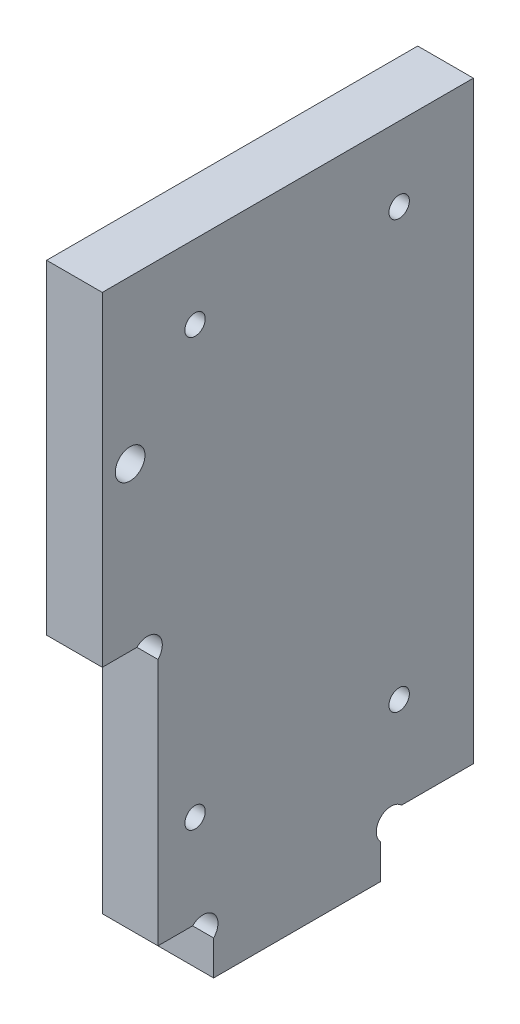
ISO-10303-21;
HEADER;
FILE_DESCRIPTION(('STEP AP214'),'2;1');
FILE_NAME('part.step','',(''),(''),'','','');
FILE_SCHEMA(('AUTOMOTIVE_DESIGN { 1 0 10303 214 1 1 1 1 }'));
ENDSEC;
DATA;
#1=APPLICATION_CONTEXT('core data for automotive mechanical design processes');
#2=APPLICATION_PROTOCOL_DEFINITION('international standard','automotive_design',2000,#1);
#3=PRODUCT_CONTEXT('',#1,'mechanical');
#4=PRODUCT('Part','Part','',(#3));
#5=PRODUCT_RELATED_PRODUCT_CATEGORY('part','',(#4));
#6=PRODUCT_DEFINITION_FORMATION('','',#4);
#7=PRODUCT_DEFINITION_CONTEXT('part definition',#1,'design');
#8=PRODUCT_DEFINITION('design','',#6,#7);
#9=PRODUCT_DEFINITION_SHAPE('','',#8);
#10=(LENGTH_UNIT() NAMED_UNIT(*) SI_UNIT(.MILLI.,.METRE.));
#11=(NAMED_UNIT(*) PLANE_ANGLE_UNIT() SI_UNIT($,.RADIAN.));
#12=(NAMED_UNIT(*) SI_UNIT($,.STERADIAN.) SOLID_ANGLE_UNIT());
#13=UNCERTAINTY_MEASURE_WITH_UNIT(LENGTH_MEASURE(1.E-05),#10,'distance_accuracy_value','');
#14=(GEOMETRIC_REPRESENTATION_CONTEXT(3) GLOBAL_UNCERTAINTY_ASSIGNED_CONTEXT((#13)) GLOBAL_UNIT_ASSIGNED_CONTEXT((#10,
#11,#12)) REPRESENTATION_CONTEXT('',''));
#15=CARTESIAN_POINT('',(0.,0.,0.));
#16=DIRECTION('',(0.,0.,1.));
#17=DIRECTION('',(1.,0.,0.));
#18=AXIS2_PLACEMENT_3D('',#15,#16,#17);
#19=CARTESIAN_POINT('',(6.,4.86862915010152,-10.1313708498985));
#20=DIRECTION('',(1.,0.,0.));
#21=DIRECTION('',(0.,0.,-1.));
#22=AXIS2_PLACEMENT_3D('',#19,#20,#21);
#23=PLANE('',#22);
#24=CARTESIAN_POINT('',(6.,16.,11.));
#25=DIRECTION('',(1.,0.,0.));
#26=DIRECTION('',(0.,0.,1.));
#27=AXIS2_PLACEMENT_3D('',#24,#25,#26);
#28=CIRCLE('',#27,1.1);
#29=CARTESIAN_POINT('',(6.,16.,12.1));
#30=VERTEX_POINT('',#29);
#31=EDGE_CURVE('E313',#30,#30,#28,.T.);
#32=ORIENTED_EDGE('',*,*,#31,.F.);
#33=EDGE_LOOP('',(#32));
#34=FACE_BOUND('',#33,.T.);
#35=CARTESIAN_POINT('',(6.,62.,-11.));
#36=DIRECTION('',(1.,0.,0.));
#37=DIRECTION('',(0.,0.,-1.));
#38=AXIS2_PLACEMENT_3D('',#35,#36,#37);
#39=CIRCLE('',#38,1.1);
#40=CARTESIAN_POINT('',(6.,62.,-12.1));
#41=VERTEX_POINT('',#40);
#42=EDGE_CURVE('E325',#41,#41,#39,.T.);
#43=ORIENTED_EDGE('',*,*,#42,.F.);
#44=EDGE_LOOP('',(#43));
#45=FACE_BOUND('',#44,.T.);
#46=CARTESIAN_POINT('',(6.,4.86862915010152,-10.1313708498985));
#47=DIRECTION('',(-1.,0.,0.));
#48=DIRECTION('',(0.,0.,-1.));
#49=AXIS2_PLACEMENT_3D('',#46,#47,#48);
#50=CIRCLE('',#49,1.6);
#51=CARTESIAN_POINT('',(6.,3.73725830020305,-9.));
#52=VERTEX_POINT('',#51);
#53=CARTESIAN_POINT('',(6.,5.99999999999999,-11.262741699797));
#54=VERTEX_POINT('',#53);
#55=EDGE_CURVE('E189',#52,#54,#50,.T.);
#56=ORIENTED_EDGE('',*,*,#55,.T.);
#57=DIRECTION('',(0.,0.,-1.));
#58=VECTOR('',#57,1.);
#59=CARTESIAN_POINT('',(6.,5.99999999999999,-11.262741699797));
#60=LINE('',#59,#58);
#61=CARTESIAN_POINT('',(6.,6.,-19.));
#62=VERTEX_POINT('',#61);
#63=EDGE_CURVE('E112',#54,#62,#60,.T.);
#64=ORIENTED_EDGE('',*,*,#63,.T.);
#65=DIRECTION('',(0.,1.,0.));
#66=VECTOR('',#65,1.);
#67=CARTESIAN_POINT('',(6.,6.,-19.));
#68=LINE('',#67,#66);
#69=CARTESIAN_POINT('',(6.,70.,-19.));
#70=VERTEX_POINT('',#69);
#71=EDGE_CURVE('E219',#62,#70,#68,.T.);
#72=ORIENTED_EDGE('',*,*,#71,.T.);
#73=DIRECTION('',(0.,0.,1.));
#74=VECTOR('',#73,1.);
#75=CARTESIAN_POINT('',(6.,70.,-19.));
#76=LINE('',#75,#74);
#77=CARTESIAN_POINT('',(6.,70.,21.));
#78=VERTEX_POINT('',#77);
#79=EDGE_CURVE('E238',#70,#78,#76,.T.);
#80=ORIENTED_EDGE('',*,*,#79,.T.);
#81=DIRECTION('',(0.,-1.,0.));
#82=VECTOR('',#81,1.);
#83=CARTESIAN_POINT('',(6.,70.,21.));
#84=LINE('',#83,#82);
#85=CARTESIAN_POINT('',(6.,35.,21.));
#86=VERTEX_POINT('',#85);
#87=EDGE_CURVE('E235',#78,#86,#84,.T.);
#88=ORIENTED_EDGE('',*,*,#87,.T.);
#89=DIRECTION('',(0.,0.,-1.));
#90=VECTOR('',#89,1.);
#91=CARTESIAN_POINT('',(6.,35.,21.));
#92=LINE('',#91,#90);
#93=CARTESIAN_POINT('',(6.,35.,17.262741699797));
#94=VERTEX_POINT('',#93);
#95=EDGE_CURVE('E237',#86,#94,#92,.T.);
#96=ORIENTED_EDGE('',*,*,#95,.T.);
#97=CARTESIAN_POINT('',(6.,33.8686291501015,16.1313708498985));
#98=DIRECTION('',(-1.,0.,0.));
#99=DIRECTION('',(0.,0.,-1.));
#100=AXIS2_PLACEMENT_3D('',#97,#98,#99);
#101=CIRCLE('',#100,1.60000000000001);
#102=CARTESIAN_POINT('',(6.,32.737258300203,15.));
#103=VERTEX_POINT('',#102);
#104=EDGE_CURVE('E240',#94,#103,#101,.T.);
#105=ORIENTED_EDGE('',*,*,#104,.T.);
#106=DIRECTION('',(0.,-1.,0.));
#107=VECTOR('',#106,1.);
#108=CARTESIAN_POINT('',(6.,32.737258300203,15.));
#109=LINE('',#108,#107);
#110=CARTESIAN_POINT('',(6.,5.99999999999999,15.));
#111=VERTEX_POINT('',#110);
#112=EDGE_CURVE('E246',#103,#111,#109,.T.);
#113=ORIENTED_EDGE('',*,*,#112,.T.);
#114=DIRECTION('',(0.,0.,-1.));
#115=VECTOR('',#114,1.);
#116=CARTESIAN_POINT('',(6.,5.99999999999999,11.262741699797));
#117=LINE('',#116,#115);
#118=CARTESIAN_POINT('',(6.,5.99999999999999,11.262741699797));
#119=VERTEX_POINT('',#118);
#120=EDGE_CURVE('E248',#111,#119,#117,.T.);
#121=ORIENTED_EDGE('',*,*,#120,.T.);
#122=CARTESIAN_POINT('',(6.,4.86862915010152,10.1313708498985));
#123=DIRECTION('',(-1.,0.,0.));
#124=DIRECTION('',(0.,0.,1.));
#125=AXIS2_PLACEMENT_3D('',#122,#123,#124);
#126=CIRCLE('',#125,1.6);
#127=CARTESIAN_POINT('',(6.,3.73725830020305,9.));
#128=VERTEX_POINT('',#127);
#129=EDGE_CURVE('E146',#119,#128,#126,.T.);
#130=ORIENTED_EDGE('',*,*,#129,.T.);
#131=DIRECTION('',(0.,-1.,0.));
#132=VECTOR('',#131,1.);
#133=CARTESIAN_POINT('',(6.,3.73725830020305,9.));
#134=LINE('',#133,#132);
#135=CARTESIAN_POINT('',(6.,0.,9.));
#136=VERTEX_POINT('',#135);
#137=EDGE_CURVE('E140',#128,#136,#134,.T.);
#138=ORIENTED_EDGE('',*,*,#137,.T.);
#139=DIRECTION('',(0.,0.,-1.));
#140=VECTOR('',#139,1.);
#141=CARTESIAN_POINT('',(6.,0.,9.));
#142=LINE('',#141,#140);
#143=CARTESIAN_POINT('',(6.,0.,-9.));
#144=VERTEX_POINT('',#143);
#145=EDGE_CURVE('E144',#136,#144,#142,.T.);
#146=ORIENTED_EDGE('',*,*,#145,.T.);
#147=DIRECTION('',(0.,1.,0.));
#148=VECTOR('',#147,1.);
#149=CARTESIAN_POINT('',(6.,3.73725830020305,-9.));
#150=LINE('',#149,#148);
#151=EDGE_CURVE('E54',#144,#52,#150,.T.);
#152=ORIENTED_EDGE('',*,*,#151,.T.);
#153=EDGE_LOOP('',(#56,#64,#72,#80,#88,#96,#105,#113,#121,#130,#138,#146,#152));
#154=FACE_BOUND('',#153,.T.);
#155=CARTESIAN_POINT('',(6.,16.,-11.));
#156=DIRECTION('',(1.,0.,0.));
#157=DIRECTION('',(0.,0.,-1.));
#158=AXIS2_PLACEMENT_3D('',#155,#156,#157);
#159=CIRCLE('',#158,1.1);
#160=CARTESIAN_POINT('',(6.,16.,-12.1));
#161=VERTEX_POINT('',#160);
#162=EDGE_CURVE('E168',#161,#161,#159,.T.);
#163=ORIENTED_EDGE('',*,*,#162,.F.);
#164=EDGE_LOOP('',(#163));
#165=FACE_BOUND('',#164,.T.);
#166=CARTESIAN_POINT('',(6.,62.,11.));
#167=DIRECTION('',(1.,0.,0.));
#168=DIRECTION('',(0.,0.,1.));
#169=AXIS2_PLACEMENT_3D('',#166,#167,#168);
#170=CIRCLE('',#169,1.1);
#171=CARTESIAN_POINT('',(6.,62.,12.1));
#172=VERTEX_POINT('',#171);
#173=EDGE_CURVE('E319',#172,#172,#170,.T.);
#174=ORIENTED_EDGE('',*,*,#173,.F.);
#175=EDGE_LOOP('',(#174));
#176=FACE_BOUND('',#175,.T.);
#177=CARTESIAN_POINT('',(6.,52.5,18.));
#178=DIRECTION('',(1.,0.,0.));
#179=DIRECTION('',(0.,0.,-1.));
#180=AXIS2_PLACEMENT_3D('',#177,#178,#179);
#181=CIRCLE('',#180,1.6);
#182=CARTESIAN_POINT('',(6.,52.5,16.4));
#183=VERTEX_POINT('',#182);
#184=EDGE_CURVE('E304',#183,#183,#181,.T.);
#185=ORIENTED_EDGE('',*,*,#184,.F.);
#186=EDGE_LOOP('',(#185));
#187=FACE_BOUND('',#186,.T.);
#188=ADVANCED_FACE('F37',(#34,#45,#154,#165,#176,#187),#23,.T.);
#189=CARTESIAN_POINT('',(0.,4.86862915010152,-10.1313708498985));
#190=DIRECTION('',(1.,0.,0.));
#191=DIRECTION('',(0.,0.,-1.));
#192=AXIS2_PLACEMENT_3D('',#189,#190,#191);
#193=PLANE('',#192);
#194=CARTESIAN_POINT('',(0.,16.,11.));
#195=DIRECTION('',(1.,0.,0.));
#196=DIRECTION('',(0.,0.,1.));
#197=AXIS2_PLACEMENT_3D('',#194,#195,#196);
#198=CIRCLE('',#197,1.1);
#199=CARTESIAN_POINT('',(0.,16.,12.1));
#200=VERTEX_POINT('',#199);
#201=EDGE_CURVE('E310',#200,#200,#198,.T.);
#202=ORIENTED_EDGE('',*,*,#201,.T.);
#203=EDGE_LOOP('',(#202));
#204=FACE_BOUND('',#203,.T.);
#205=CARTESIAN_POINT('',(0.,62.,-11.));
#206=DIRECTION('',(1.,0.,0.));
#207=DIRECTION('',(0.,0.,-1.));
#208=AXIS2_PLACEMENT_3D('',#205,#206,#207);
#209=CIRCLE('',#208,1.1);
#210=CARTESIAN_POINT('',(0.,62.,-12.1));
#211=VERTEX_POINT('',#210);
#212=EDGE_CURVE('E322',#211,#211,#209,.T.);
#213=ORIENTED_EDGE('',*,*,#212,.T.);
#214=EDGE_LOOP('',(#213));
#215=FACE_BOUND('',#214,.T.);
#216=CARTESIAN_POINT('',(0.,4.86862915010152,-10.1313708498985));
#217=DIRECTION('',(-1.,0.,0.));
#218=DIRECTION('',(0.,0.,-1.));
#219=AXIS2_PLACEMENT_3D('',#216,#217,#218);
#220=CIRCLE('',#219,1.6);
#221=CARTESIAN_POINT('',(0.,3.73725830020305,-9.));
#222=VERTEX_POINT('',#221);
#223=CARTESIAN_POINT('',(0.,5.99999999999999,-11.262741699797));
#224=VERTEX_POINT('',#223);
#225=EDGE_CURVE('E164',#222,#224,#220,.T.);
#226=ORIENTED_EDGE('',*,*,#225,.F.);
#227=DIRECTION('',(0.,1.,0.));
#228=VECTOR('',#227,1.);
#229=CARTESIAN_POINT('',(0.,3.73725830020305,-9.));
#230=LINE('',#229,#228);
#231=CARTESIAN_POINT('',(0.,0.,-9.));
#232=VERTEX_POINT('',#231);
#233=EDGE_CURVE('E104',#232,#222,#230,.T.);
#234=ORIENTED_EDGE('',*,*,#233,.F.);
#235=DIRECTION('',(0.,0.,-1.));
#236=VECTOR('',#235,1.);
#237=CARTESIAN_POINT('',(0.,0.,9.));
#238=LINE('',#237,#236);
#239=CARTESIAN_POINT('',(0.,0.,9.));
#240=VERTEX_POINT('',#239);
#241=EDGE_CURVE('E98',#240,#232,#238,.T.);
#242=ORIENTED_EDGE('',*,*,#241,.F.);
#243=DIRECTION('',(0.,-1.,0.));
#244=VECTOR('',#243,1.);
#245=CARTESIAN_POINT('',(0.,3.73725830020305,9.));
#246=LINE('',#245,#244);
#247=CARTESIAN_POINT('',(0.,3.73725830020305,9.));
#248=VERTEX_POINT('',#247);
#249=EDGE_CURVE('E154',#248,#240,#246,.T.);
#250=ORIENTED_EDGE('',*,*,#249,.F.);
#251=CARTESIAN_POINT('',(0.,4.86862915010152,10.1313708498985));
#252=DIRECTION('',(-1.,0.,0.));
#253=DIRECTION('',(0.,0.,1.));
#254=AXIS2_PLACEMENT_3D('',#251,#252,#253);
#255=CIRCLE('',#254,1.6);
#256=CARTESIAN_POINT('',(0.,5.99999999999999,11.262741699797));
#257=VERTEX_POINT('',#256);
#258=EDGE_CURVE('E184',#257,#248,#255,.T.);
#259=ORIENTED_EDGE('',*,*,#258,.F.);
#260=DIRECTION('',(0.,0.,-1.));
#261=VECTOR('',#260,1.);
#262=CARTESIAN_POINT('',(0.,5.99999999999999,11.262741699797));
#263=LINE('',#262,#261);
#264=CARTESIAN_POINT('',(0.,5.99999999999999,15.));
#265=VERTEX_POINT('',#264);
#266=EDGE_CURVE('E182',#265,#257,#263,.T.);
#267=ORIENTED_EDGE('',*,*,#266,.F.);
#268=DIRECTION('',(0.,-1.,0.));
#269=VECTOR('',#268,1.);
#270=CARTESIAN_POINT('',(0.,32.737258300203,15.));
#271=LINE('',#270,#269);
#272=CARTESIAN_POINT('',(0.,32.737258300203,15.));
#273=VERTEX_POINT('',#272);
#274=EDGE_CURVE('E180',#273,#265,#271,.T.);
#275=ORIENTED_EDGE('',*,*,#274,.F.);
#276=CARTESIAN_POINT('',(0.,33.8686291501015,16.1313708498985));
#277=DIRECTION('',(-1.,0.,0.));
#278=DIRECTION('',(0.,0.,-1.));
#279=AXIS2_PLACEMENT_3D('',#276,#277,#278);
#280=CIRCLE('',#279,1.60000000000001);
#281=CARTESIAN_POINT('',(0.,35.,17.262741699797));
#282=VERTEX_POINT('',#281);
#283=EDGE_CURVE('E178',#282,#273,#280,.T.);
#284=ORIENTED_EDGE('',*,*,#283,.F.);
#285=DIRECTION('',(0.,0.,-1.));
#286=VECTOR('',#285,1.);
#287=CARTESIAN_POINT('',(0.,35.,21.));
#288=LINE('',#287,#286);
#289=CARTESIAN_POINT('',(0.,35.,21.));
#290=VERTEX_POINT('',#289);
#291=EDGE_CURVE('E176',#290,#282,#288,.T.);
#292=ORIENTED_EDGE('',*,*,#291,.F.);
#293=DIRECTION('',(0.,-1.,0.));
#294=VECTOR('',#293,1.);
#295=CARTESIAN_POINT('',(0.,70.,21.));
#296=LINE('',#295,#294);
#297=CARTESIAN_POINT('',(0.,70.,21.));
#298=VERTEX_POINT('',#297);
#299=EDGE_CURVE('E174',#298,#290,#296,.T.);
#300=ORIENTED_EDGE('',*,*,#299,.F.);
#301=DIRECTION('',(0.,0.,1.));
#302=VECTOR('',#301,1.);
#303=CARTESIAN_POINT('',(0.,70.,-19.));
#304=LINE('',#303,#302);
#305=CARTESIAN_POINT('',(0.,70.,-19.));
#306=VERTEX_POINT('',#305);
#307=EDGE_CURVE('E172',#306,#298,#304,.T.);
#308=ORIENTED_EDGE('',*,*,#307,.F.);
#309=DIRECTION('',(0.,1.,0.));
#310=VECTOR('',#309,1.);
#311=CARTESIAN_POINT('',(0.,6.,-19.));
#312=LINE('',#311,#310);
#313=CARTESIAN_POINT('',(0.,6.,-19.));
#314=VERTEX_POINT('',#313);
#315=EDGE_CURVE('E170',#314,#306,#312,.T.);
#316=ORIENTED_EDGE('',*,*,#315,.F.);
#317=DIRECTION('',(0.,0.,-1.));
#318=VECTOR('',#317,1.);
#319=CARTESIAN_POINT('',(0.,5.99999999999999,-11.262741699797));
#320=LINE('',#319,#318);
#321=EDGE_CURVE('E167',#224,#314,#320,.T.);
#322=ORIENTED_EDGE('',*,*,#321,.F.);
#323=EDGE_LOOP('',(#226,#234,#242,#250,#259,#267,#275,#284,#292,#300,#308,#316,#322));
#324=FACE_BOUND('',#323,.T.);
#325=CARTESIAN_POINT('',(0.,16.,-11.));
#326=DIRECTION('',(1.,0.,0.));
#327=DIRECTION('',(0.,0.,-1.));
#328=AXIS2_PLACEMENT_3D('',#325,#326,#327);
#329=CIRCLE('',#328,1.1);
#330=CARTESIAN_POINT('',(0.,16.,-12.1));
#331=VERTEX_POINT('',#330);
#332=EDGE_CURVE('E328',#331,#331,#329,.T.);
#333=ORIENTED_EDGE('',*,*,#332,.T.);
#334=EDGE_LOOP('',(#333));
#335=FACE_BOUND('',#334,.T.);
#336=CARTESIAN_POINT('',(0.,62.,11.));
#337=DIRECTION('',(1.,0.,0.));
#338=DIRECTION('',(0.,0.,1.));
#339=AXIS2_PLACEMENT_3D('',#336,#337,#338);
#340=CIRCLE('',#339,1.1);
#341=CARTESIAN_POINT('',(0.,62.,12.1));
#342=VERTEX_POINT('',#341);
#343=EDGE_CURVE('E316',#342,#342,#340,.T.);
#344=ORIENTED_EDGE('',*,*,#343,.T.);
#345=EDGE_LOOP('',(#344));
#346=FACE_BOUND('',#345,.T.);
#347=CARTESIAN_POINT('',(0.,52.5,18.));
#348=DIRECTION('',(1.,0.,0.));
#349=DIRECTION('',(0.,0.,-1.));
#350=AXIS2_PLACEMENT_3D('',#347,#348,#349);
#351=CIRCLE('',#350,1.6);
#352=CARTESIAN_POINT('',(0.,52.5,16.4));
#353=VERTEX_POINT('',#352);
#354=EDGE_CURVE('E307',#353,#353,#351,.T.);
#355=ORIENTED_EDGE('',*,*,#354,.T.);
#356=EDGE_LOOP('',(#355));
#357=FACE_BOUND('',#356,.T.);
#358=ADVANCED_FACE('F223',(#204,#215,#324,#335,#346,#357),#193,.F.);
#359=CARTESIAN_POINT('',(6.,4.86862915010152,-10.1313708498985));
#360=DIRECTION('',(-1.,0.,0.));
#361=DIRECTION('',(0.,0.,1.));
#362=AXIS2_PLACEMENT_3D('',#359,#360,#361);
#363=CYLINDRICAL_SURFACE('',#362,1.6);
#364=ORIENTED_EDGE('',*,*,#225,.T.);
#365=DIRECTION('',(-1.,0.,0.));
#366=VECTOR('',#365,1.);
#367=CARTESIAN_POINT('',(6.,5.99999999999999,-11.262741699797));
#368=LINE('',#367,#366);
#369=EDGE_CURVE('E11',#54,#224,#368,.T.);
#370=ORIENTED_EDGE('',*,*,#369,.F.);
#371=ORIENTED_EDGE('',*,*,#55,.F.);
#372=DIRECTION('',(-1.,0.,0.));
#373=VECTOR('',#372,1.);
#374=CARTESIAN_POINT('',(6.,3.73725830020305,-9.));
#375=LINE('',#374,#373);
#376=EDGE_CURVE('E160',#52,#222,#375,.T.);
#377=ORIENTED_EDGE('',*,*,#376,.T.);
#378=EDGE_LOOP('',(#364,#370,#371,#377));
#379=FACE_BOUND('',#378,.T.);
#380=ADVANCED_FACE('F39',(#379),#363,.F.);
#381=CARTESIAN_POINT('',(6.,5.99999999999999,-11.262741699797));
#382=DIRECTION('',(0.,1.,0.));
#383=DIRECTION('',(0.,0.,1.));
#384=AXIS2_PLACEMENT_3D('',#381,#382,#383);
#385=PLANE('',#384);
#386=ORIENTED_EDGE('',*,*,#321,.T.);
#387=DIRECTION('',(-1.,0.,0.));
#388=VECTOR('',#387,1.);
#389=CARTESIAN_POINT('',(6.,6.,-19.));
#390=LINE('',#389,#388);
#391=EDGE_CURVE('E46',#62,#314,#390,.T.);
#392=ORIENTED_EDGE('',*,*,#391,.F.);
#393=ORIENTED_EDGE('',*,*,#63,.F.);
#394=ORIENTED_EDGE('',*,*,#369,.T.);
#395=EDGE_LOOP('',(#386,#392,#393,#394));
#396=FACE_BOUND('',#395,.T.);
#397=ADVANCED_FACE('F456',(#396),#385,.F.);
#398=CARTESIAN_POINT('',(6.,6.,-19.));
#399=DIRECTION('',(0.,0.,1.));
#400=DIRECTION('',(0.,-1.,0.));
#401=AXIS2_PLACEMENT_3D('',#398,#399,#400);
#402=PLANE('',#401);
#403=ORIENTED_EDGE('',*,*,#315,.T.);
#404=DIRECTION('',(-1.,0.,0.));
#405=VECTOR('',#404,1.);
#406=CARTESIAN_POINT('',(6.,70.,-19.));
#407=LINE('',#406,#405);
#408=EDGE_CURVE('E211',#70,#306,#407,.T.);
#409=ORIENTED_EDGE('',*,*,#408,.F.);
#410=ORIENTED_EDGE('',*,*,#71,.F.);
#411=ORIENTED_EDGE('',*,*,#391,.T.);
#412=EDGE_LOOP('',(#403,#409,#410,#411));
#413=FACE_BOUND('',#412,.T.);
#414=ADVANCED_FACE('F217',(#413),#402,.F.);
#415=CARTESIAN_POINT('',(6.,70.,-19.));
#416=DIRECTION('',(0.,-1.,0.));
#417=DIRECTION('',(0.,0.,-1.));
#418=AXIS2_PLACEMENT_3D('',#415,#416,#417);
#419=PLANE('',#418);
#420=ORIENTED_EDGE('',*,*,#307,.T.);
#421=DIRECTION('',(-1.,0.,0.));
#422=VECTOR('',#421,1.);
#423=CARTESIAN_POINT('',(6.,70.,21.));
#424=LINE('',#423,#422);
#425=EDGE_CURVE('E208',#78,#298,#424,.T.);
#426=ORIENTED_EDGE('',*,*,#425,.F.);
#427=ORIENTED_EDGE('',*,*,#79,.F.);
#428=ORIENTED_EDGE('',*,*,#408,.T.);
#429=EDGE_LOOP('',(#420,#426,#427,#428));
#430=FACE_BOUND('',#429,.T.);
#431=ADVANCED_FACE('F229',(#430),#419,.F.);
#432=CARTESIAN_POINT('',(6.,70.,21.));
#433=DIRECTION('',(0.,0.,-1.));
#434=DIRECTION('',(0.,1.,0.));
#435=AXIS2_PLACEMENT_3D('',#432,#433,#434);
#436=PLANE('',#435);
#437=ORIENTED_EDGE('',*,*,#299,.T.);
#438=DIRECTION('',(-1.,0.,0.));
#439=VECTOR('',#438,1.);
#440=CARTESIAN_POINT('',(6.,35.,21.));
#441=LINE('',#440,#439);
#442=EDGE_CURVE('E205',#86,#290,#441,.T.);
#443=ORIENTED_EDGE('',*,*,#442,.F.);
#444=ORIENTED_EDGE('',*,*,#87,.F.);
#445=ORIENTED_EDGE('',*,*,#425,.T.);
#446=EDGE_LOOP('',(#437,#443,#444,#445));
#447=FACE_BOUND('',#446,.T.);
#448=ADVANCED_FACE('F233',(#447),#436,.F.);
#449=CARTESIAN_POINT('',(6.,35.,21.));
#450=DIRECTION('',(0.,1.,0.));
#451=DIRECTION('',(0.,0.,1.));
#452=AXIS2_PLACEMENT_3D('',#449,#450,#451);
#453=PLANE('',#452);
#454=ORIENTED_EDGE('',*,*,#291,.T.);
#455=DIRECTION('',(-1.,0.,0.));
#456=VECTOR('',#455,1.);
#457=CARTESIAN_POINT('',(6.,35.,17.262741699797));
#458=LINE('',#457,#456);
#459=EDGE_CURVE('E202',#94,#282,#458,.T.);
#460=ORIENTED_EDGE('',*,*,#459,.F.);
#461=ORIENTED_EDGE('',*,*,#95,.F.);
#462=ORIENTED_EDGE('',*,*,#442,.T.);
#463=EDGE_LOOP('',(#454,#460,#461,#462));
#464=FACE_BOUND('',#463,.T.);
#465=ADVANCED_FACE('F421',(#464),#453,.F.);
#466=CARTESIAN_POINT('',(6.,33.8686291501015,16.1313708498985));
#467=DIRECTION('',(-1.,0.,0.));
#468=DIRECTION('',(0.,0.,1.));
#469=AXIS2_PLACEMENT_3D('',#466,#467,#468);
#470=CYLINDRICAL_SURFACE('',#469,1.60000000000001);
#471=ORIENTED_EDGE('',*,*,#283,.T.);
#472=DIRECTION('',(-1.,0.,0.));
#473=VECTOR('',#472,1.);
#474=CARTESIAN_POINT('',(6.,32.737258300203,15.));
#475=LINE('',#474,#473);
#476=EDGE_CURVE('E199',#103,#273,#475,.T.);
#477=ORIENTED_EDGE('',*,*,#476,.F.);
#478=ORIENTED_EDGE('',*,*,#104,.F.);
#479=ORIENTED_EDGE('',*,*,#459,.T.);
#480=EDGE_LOOP('',(#471,#477,#478,#479));
#481=FACE_BOUND('',#480,.T.);
#482=ADVANCED_FACE('F411',(#481),#470,.F.);
#483=CARTESIAN_POINT('',(6.,32.737258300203,15.));
#484=DIRECTION('',(0.,0.,-1.));
#485=DIRECTION('',(0.,1.,0.));
#486=AXIS2_PLACEMENT_3D('',#483,#484,#485);
#487=PLANE('',#486);
#488=ORIENTED_EDGE('',*,*,#274,.T.);
#489=DIRECTION('',(-1.,0.,0.));
#490=VECTOR('',#489,1.);
#491=CARTESIAN_POINT('',(6.,5.99999999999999,15.));
#492=LINE('',#491,#490);
#493=EDGE_CURVE('E196',#111,#265,#492,.T.);
#494=ORIENTED_EDGE('',*,*,#493,.F.);
#495=ORIENTED_EDGE('',*,*,#112,.F.);
#496=ORIENTED_EDGE('',*,*,#476,.T.);
#497=EDGE_LOOP('',(#488,#494,#495,#496));
#498=FACE_BOUND('',#497,.T.);
#499=ADVANCED_FACE('F402',(#498),#487,.F.);
#500=CARTESIAN_POINT('',(6.,5.99999999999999,11.262741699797));
#501=DIRECTION('',(0.,1.,0.));
#502=DIRECTION('',(0.,0.,1.));
#503=AXIS2_PLACEMENT_3D('',#500,#501,#502);
#504=PLANE('',#503);
#505=ORIENTED_EDGE('',*,*,#266,.T.);
#506=DIRECTION('',(-1.,0.,0.));
#507=VECTOR('',#506,1.);
#508=CARTESIAN_POINT('',(6.,5.99999999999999,11.262741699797));
#509=LINE('',#508,#507);
#510=EDGE_CURVE('E193',#119,#257,#509,.T.);
#511=ORIENTED_EDGE('',*,*,#510,.F.);
#512=ORIENTED_EDGE('',*,*,#120,.F.);
#513=ORIENTED_EDGE('',*,*,#493,.T.);
#514=EDGE_LOOP('',(#505,#511,#512,#513));
#515=FACE_BOUND('',#514,.T.);
#516=ADVANCED_FACE('F254',(#515),#504,.F.);
#517=CARTESIAN_POINT('',(6.,4.86862915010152,10.1313708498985));
#518=DIRECTION('',(-1.,0.,0.));
#519=DIRECTION('',(0.,0.,1.));
#520=AXIS2_PLACEMENT_3D('',#517,#518,#519);
#521=CYLINDRICAL_SURFACE('',#520,1.6);
#522=ORIENTED_EDGE('',*,*,#258,.T.);
#523=DIRECTION('',(-1.,0.,0.));
#524=VECTOR('',#523,1.);
#525=CARTESIAN_POINT('',(6.,3.73725830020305,9.));
#526=LINE('',#525,#524);
#527=EDGE_CURVE('E155',#128,#248,#526,.T.);
#528=ORIENTED_EDGE('',*,*,#527,.F.);
#529=ORIENTED_EDGE('',*,*,#129,.F.);
#530=ORIENTED_EDGE('',*,*,#510,.T.);
#531=EDGE_LOOP('',(#522,#528,#529,#530));
#532=FACE_BOUND('',#531,.T.);
#533=ADVANCED_FACE('F258',(#532),#521,.F.);
#534=CARTESIAN_POINT('',(6.,3.73725830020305,9.));
#535=DIRECTION('',(0.,0.,-1.));
#536=DIRECTION('',(0.,1.,0.));
#537=AXIS2_PLACEMENT_3D('',#534,#535,#536);
#538=PLANE('',#537);
#539=ORIENTED_EDGE('',*,*,#249,.T.);
#540=DIRECTION('',(-1.,0.,0.));
#541=VECTOR('',#540,1.);
#542=CARTESIAN_POINT('',(6.,0.,9.));
#543=LINE('',#542,#541);
#544=EDGE_CURVE('E151',#136,#240,#543,.T.);
#545=ORIENTED_EDGE('',*,*,#544,.F.);
#546=ORIENTED_EDGE('',*,*,#137,.F.);
#547=ORIENTED_EDGE('',*,*,#527,.T.);
#548=EDGE_LOOP('',(#539,#545,#546,#547));
#549=FACE_BOUND('',#548,.T.);
#550=ADVANCED_FACE('F152',(#549),#538,.F.);
#551=CARTESIAN_POINT('',(6.,0.,9.));
#552=DIRECTION('',(0.,1.,0.));
#553=DIRECTION('',(0.,0.,1.));
#554=AXIS2_PLACEMENT_3D('',#551,#552,#553);
#555=PLANE('',#554);
#556=ORIENTED_EDGE('',*,*,#241,.T.);
#557=DIRECTION('',(-1.,0.,0.));
#558=VECTOR('',#557,1.);
#559=CARTESIAN_POINT('',(6.,0.,-9.));
#560=LINE('',#559,#558);
#561=EDGE_CURVE('E156',#144,#232,#560,.T.);
#562=ORIENTED_EDGE('',*,*,#561,.F.);
#563=ORIENTED_EDGE('',*,*,#145,.F.);
#564=ORIENTED_EDGE('',*,*,#544,.T.);
#565=EDGE_LOOP('',(#556,#562,#563,#564));
#566=FACE_BOUND('',#565,.T.);
#567=ADVANCED_FACE('F158',(#566),#555,.F.);
#568=CARTESIAN_POINT('',(6.,3.73725830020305,-9.));
#569=DIRECTION('',(0.,0.,1.));
#570=DIRECTION('',(0.,-1.,0.));
#571=AXIS2_PLACEMENT_3D('',#568,#569,#570);
#572=PLANE('',#571);
#573=ORIENTED_EDGE('',*,*,#233,.T.);
#574=ORIENTED_EDGE('',*,*,#376,.F.);
#575=ORIENTED_EDGE('',*,*,#151,.F.);
#576=ORIENTED_EDGE('',*,*,#561,.T.);
#577=EDGE_LOOP('',(#573,#574,#575,#576));
#578=FACE_BOUND('',#577,.T.);
#579=ADVANCED_FACE('F262',(#578),#572,.F.);
#580=CARTESIAN_POINT('',(6.,16.,-11.));
#581=DIRECTION('',(-1.,0.,0.));
#582=DIRECTION('',(0.,0.,1.));
#583=AXIS2_PLACEMENT_3D('',#580,#581,#582);
#584=CYLINDRICAL_SURFACE('',#583,1.1);
#585=ORIENTED_EDGE('',*,*,#162,.T.);
#586=EDGE_LOOP('',(#585));
#587=FACE_BOUND('',#586,.T.);
#588=ORIENTED_EDGE('',*,*,#332,.F.);
#589=EDGE_LOOP('',(#588));
#590=FACE_BOUND('',#589,.T.);
#591=ADVANCED_FACE('F264',(#587,#590),#584,.F.);
#592=CARTESIAN_POINT('',(6.,62.,-11.));
#593=DIRECTION('',(-1.,0.,0.));
#594=DIRECTION('',(0.,0.,1.));
#595=AXIS2_PLACEMENT_3D('',#592,#593,#594);
#596=CYLINDRICAL_SURFACE('',#595,1.1);
#597=ORIENTED_EDGE('',*,*,#42,.T.);
#598=EDGE_LOOP('',(#597));
#599=FACE_BOUND('',#598,.T.);
#600=ORIENTED_EDGE('',*,*,#212,.F.);
#601=EDGE_LOOP('',(#600));
#602=FACE_BOUND('',#601,.T.);
#603=ADVANCED_FACE('F270',(#599,#602),#596,.F.);
#604=CARTESIAN_POINT('',(6.,62.,11.));
#605=DIRECTION('',(-1.,0.,0.));
#606=DIRECTION('',(0.,0.,1.));
#607=AXIS2_PLACEMENT_3D('',#604,#605,#606);
#608=CYLINDRICAL_SURFACE('',#607,1.1);
#609=ORIENTED_EDGE('',*,*,#173,.T.);
#610=EDGE_LOOP('',(#609));
#611=FACE_BOUND('',#610,.T.);
#612=ORIENTED_EDGE('',*,*,#343,.F.);
#613=EDGE_LOOP('',(#612));
#614=FACE_BOUND('',#613,.T.);
#615=ADVANCED_FACE('F287',(#611,#614),#608,.F.);
#616=CARTESIAN_POINT('',(6.,16.,11.));
#617=DIRECTION('',(-1.,0.,0.));
#618=DIRECTION('',(0.,0.,1.));
#619=AXIS2_PLACEMENT_3D('',#616,#617,#618);
#620=CYLINDRICAL_SURFACE('',#619,1.1);
#621=ORIENTED_EDGE('',*,*,#31,.T.);
#622=EDGE_LOOP('',(#621));
#623=FACE_BOUND('',#622,.T.);
#624=ORIENTED_EDGE('',*,*,#201,.F.);
#625=EDGE_LOOP('',(#624));
#626=FACE_BOUND('',#625,.T.);
#627=ADVANCED_FACE('F291',(#623,#626),#620,.F.);
#628=CARTESIAN_POINT('',(6.,52.5,18.));
#629=DIRECTION('',(-1.,0.,0.));
#630=DIRECTION('',(0.,0.,1.));
#631=AXIS2_PLACEMENT_3D('',#628,#629,#630);
#632=CYLINDRICAL_SURFACE('',#631,1.6);
#633=ORIENTED_EDGE('',*,*,#184,.T.);
#634=EDGE_LOOP('',(#633));
#635=FACE_BOUND('',#634,.T.);
#636=ORIENTED_EDGE('',*,*,#354,.F.);
#637=EDGE_LOOP('',(#636));
#638=FACE_BOUND('',#637,.T.);
#639=ADVANCED_FACE('F295',(#635,#638),#632,.F.);
#640=CLOSED_SHELL('',(#188,#358,#380,#397,#414,#431,#448,#465,#482,#499,#516,#533,#550,#567,
#579,#591,#603,#615,#627,#639));
#641=MANIFOLD_SOLID_BREP('B2',#640);
#642=ADVANCED_BREP_SHAPE_REPRESENTATION('',(#18,#641),#14);
#643=SHAPE_DEFINITION_REPRESENTATION(#9,#642);
ENDSEC;
END-ISO-10303-21;
